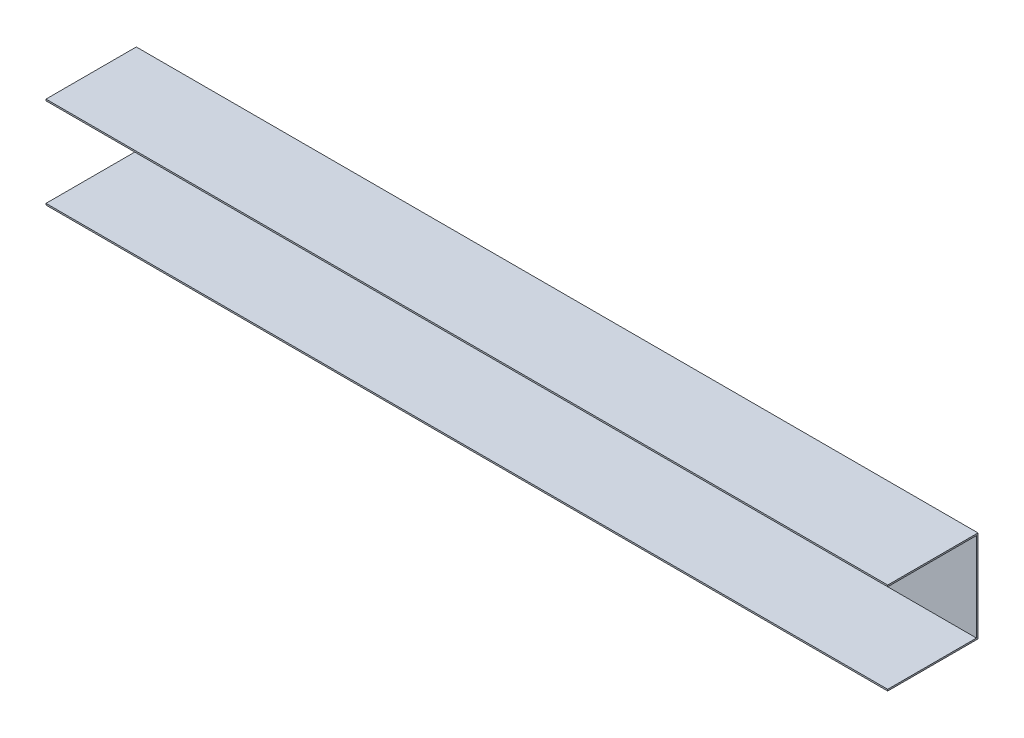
from build123d import *

# Parameters (mm, degrees)
EW_EXTRUDE_DEPTH = 550


with BuildPart() as part:
    # EW_SKETCH → EW_EXTRUDE (new body)
    with BuildSketch(Plane(origin=(0, 0, 0), x_dir=(0, 0, -1), z_dir=(1, 0, 0))):
        Polygon((0, -30), (0, 30), (-59, 30), (-59, 29), (-1, 29), (-1, -29), (-59, -29), (-59, -30), align=None)
    extrude(amount=EW_EXTRUDE_DEPTH)


solid = part.part
